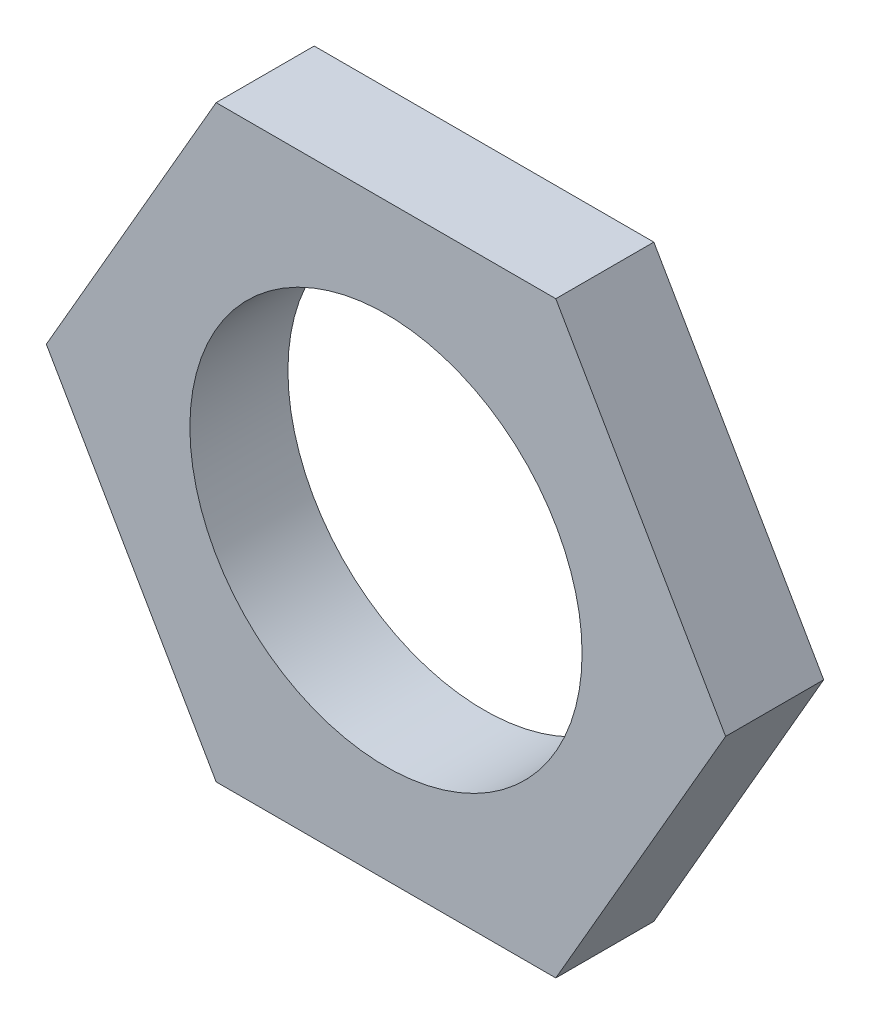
from build123d import *

# Parameters (mm, degrees)
SKETCH1_R           = 4
BOSS_EXTRUDE1_DEPTH = 2


with BuildPart() as part:
    # Sketch1 → Boss-Extrude1 (new body)
    with BuildSketch(Plane.XY):
        Polygon((6.92820323, 0), (3.464101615, 6), (-3.464101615, 6), (-6.92820323, 0), (-3.464101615, -6), (3.464101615, -6), align=None)
        Circle(SKETCH1_R, mode=Mode.SUBTRACT)
    extrude(amount=BOSS_EXTRUDE1_DEPTH)


solid = part.part
